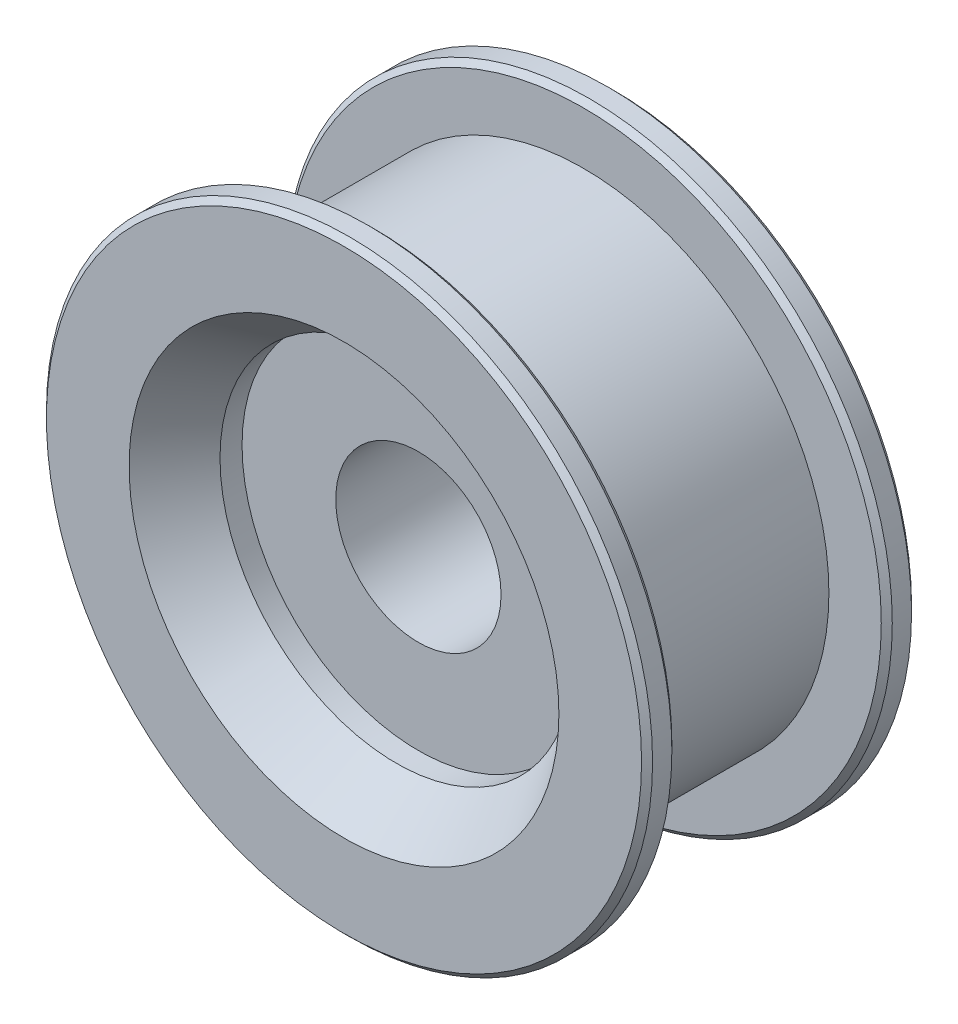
ISO-10303-21;
HEADER;
FILE_DESCRIPTION(('STEP AP214'),'2;1');
FILE_NAME('part.step','',(''),(''),'','','');
FILE_SCHEMA(('AUTOMOTIVE_DESIGN { 1 0 10303 214 1 1 1 1 }'));
ENDSEC;
DATA;
#1=APPLICATION_CONTEXT('core data for automotive mechanical design processes');
#2=APPLICATION_PROTOCOL_DEFINITION('international standard','automotive_design',2000,#1);
#3=PRODUCT_CONTEXT('',#1,'mechanical');
#4=PRODUCT('Part','Part','',(#3));
#5=PRODUCT_RELATED_PRODUCT_CATEGORY('part','',(#4));
#6=PRODUCT_DEFINITION_FORMATION('','',#4);
#7=PRODUCT_DEFINITION_CONTEXT('part definition',#1,'design');
#8=PRODUCT_DEFINITION('design','',#6,#7);
#9=PRODUCT_DEFINITION_SHAPE('','',#8);
#10=(LENGTH_UNIT() NAMED_UNIT(*) SI_UNIT(.MILLI.,.METRE.));
#11=(NAMED_UNIT(*) PLANE_ANGLE_UNIT() SI_UNIT($,.RADIAN.));
#12=(NAMED_UNIT(*) SI_UNIT($,.STERADIAN.) SOLID_ANGLE_UNIT());
#13=UNCERTAINTY_MEASURE_WITH_UNIT(LENGTH_MEASURE(1.E-05),#10,'distance_accuracy_value','');
#14=(GEOMETRIC_REPRESENTATION_CONTEXT(3) GLOBAL_UNCERTAINTY_ASSIGNED_CONTEXT((#13)) GLOBAL_UNIT_ASSIGNED_CONTEXT((#10,
#11,#12)) REPRESENTATION_CONTEXT('',''));
#15=CARTESIAN_POINT('',(0.,0.,0.));
#16=DIRECTION('',(0.,0.,1.));
#17=DIRECTION('',(1.,0.,0.));
#18=AXIS2_PLACEMENT_3D('',#15,#16,#17);
#19=CARTESIAN_POINT('',(0.,-7.5,-5.5));
#20=DIRECTION('',(0.,0.,-1.));
#21=DIRECTION('',(1.,0.,0.));
#22=AXIS2_PLACEMENT_3D('',#19,#20,#21);
#23=PLANE('',#22);
#24=CARTESIAN_POINT('',(0.,0.,-5.5));
#25=DIRECTION('',(0.,0.,-1.));
#26=DIRECTION('',(1.,0.,0.));
#27=AXIS2_PLACEMENT_3D('',#24,#25,#26);
#28=CIRCLE('',#27,16.);
#29=CARTESIAN_POINT('',(16.,0.,-5.5));
#30=VERTEX_POINT('',#29);
#31=EDGE_CURVE('E44',#30,#30,#28,.T.);
#32=ORIENTED_EDGE('',*,*,#31,.T.);
#33=EDGE_LOOP('',(#32));
#34=FACE_BOUND('',#33,.T.);
#35=CARTESIAN_POINT('',(0.,0.,-5.5));
#36=DIRECTION('',(0.,0.,-1.));
#37=DIRECTION('',(1.,0.,0.));
#38=AXIS2_PLACEMENT_3D('',#35,#36,#37);
#39=CIRCLE('',#38,7.5);
#40=CARTESIAN_POINT('',(7.5,0.,-5.5));
#41=VERTEX_POINT('',#40);
#42=EDGE_CURVE('E71',#41,#41,#39,.T.);
#43=ORIENTED_EDGE('',*,*,#42,.F.);
#44=EDGE_LOOP('',(#43));
#45=FACE_BOUND('',#44,.T.);
#46=ADVANCED_FACE('F12',(#34,#45),#23,.T.);
#47=CARTESIAN_POINT('',(0.,0.,-20.));
#48=DIRECTION('',(0.,0.,-1.));
#49=DIRECTION('',(1.,0.,0.));
#50=AXIS2_PLACEMENT_3D('',#47,#48,#49);
#51=CYLINDRICAL_SURFACE('',#50,16.);
#52=CARTESIAN_POINT('',(0.,0.,-7.5));
#53=DIRECTION('',(0.,0.,-1.));
#54=DIRECTION('',(1.,0.,0.));
#55=AXIS2_PLACEMENT_3D('',#52,#53,#54);
#56=CIRCLE('',#55,16.);
#57=CARTESIAN_POINT('',(16.,0.,-7.5));
#58=VERTEX_POINT('',#57);
#59=EDGE_CURVE('E47',#58,#58,#56,.T.);
#60=ORIENTED_EDGE('',*,*,#59,.T.);
#61=EDGE_LOOP('',(#60));
#62=FACE_BOUND('',#61,.T.);
#63=ORIENTED_EDGE('',*,*,#31,.F.);
#64=EDGE_LOOP('',(#63));
#65=FACE_BOUND('',#64,.T.);
#66=ADVANCED_FACE('F79',(#62,#65),#51,.F.);
#67=CARTESIAN_POINT('',(0.,0.,-7.5));
#68=DIRECTION('',(0.,0.,-1.));
#69=DIRECTION('',(1.,0.,0.));
#70=AXIS2_PLACEMENT_3D('',#67,#68,#69);
#71=CONICAL_SURFACE('',#70,16.,0.635026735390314);
#72=CARTESIAN_POINT('',(0.,0.,-12.25));
#73=DIRECTION('',(0.,0.,-1.));
#74=DIRECTION('',(1.,0.,0.));
#75=AXIS2_PLACEMENT_3D('',#72,#73,#74);
#76=CIRCLE('',#75,19.5);
#77=CARTESIAN_POINT('',(19.5,0.,-12.25));
#78=VERTEX_POINT('',#77);
#79=EDGE_CURVE('E50',#78,#78,#76,.T.);
#80=ORIENTED_EDGE('',*,*,#79,.T.);
#81=EDGE_LOOP('',(#80));
#82=FACE_BOUND('',#81,.T.);
#83=ORIENTED_EDGE('',*,*,#59,.F.);
#84=EDGE_LOOP('',(#83));
#85=FACE_BOUND('',#84,.T.);
#86=ADVANCED_FACE('F87',(#82,#85),#71,.F.);
#87=CARTESIAN_POINT('',(0.,-27.5,-12.25));
#88=DIRECTION('',(0.,0.,1.));
#89=DIRECTION('',(-1.,0.,0.));
#90=AXIS2_PLACEMENT_3D('',#87,#88,#89);
#91=PLANE('',#90);
#92=CARTESIAN_POINT('',(0.,0.,-12.25));
#93=DIRECTION('',(0.,0.,1.));
#94=DIRECTION('',(1.,0.,0.));
#95=AXIS2_PLACEMENT_3D('',#92,#93,#94);
#96=CIRCLE('',#95,27.);
#97=CARTESIAN_POINT('',(27.,0.,-12.25));
#98=VERTEX_POINT('',#97);
#99=EDGE_CURVE('E41',#98,#98,#96,.F.);
#100=ORIENTED_EDGE('',*,*,#99,.T.);
#101=EDGE_LOOP('',(#100));
#102=FACE_BOUND('',#101,.T.);
#103=ORIENTED_EDGE('',*,*,#79,.F.);
#104=EDGE_LOOP('',(#103));
#105=FACE_BOUND('',#104,.T.);
#106=ADVANCED_FACE('F132',(#102,#105),#91,.F.);
#107=CARTESIAN_POINT('',(0.,0.,-20.));
#108=DIRECTION('',(0.,0.,-1.));
#109=DIRECTION('',(1.,0.,0.));
#110=AXIS2_PLACEMENT_3D('',#107,#108,#109);
#111=CYLINDRICAL_SURFACE('',#110,27.5);
#112=CARTESIAN_POINT('',(0.,0.,-11.75));
#113=DIRECTION('',(0.,0.,1.));
#114=DIRECTION('',(1.,0.,0.));
#115=AXIS2_PLACEMENT_3D('',#112,#113,#114);
#116=CIRCLE('',#115,27.5);
#117=CARTESIAN_POINT('',(27.5,0.,-11.75));
#118=VERTEX_POINT('',#117);
#119=EDGE_CURVE('E35',#118,#118,#116,.T.);
#120=ORIENTED_EDGE('',*,*,#119,.T.);
#121=EDGE_LOOP('',(#120));
#122=FACE_BOUND('',#121,.T.);
#123=CARTESIAN_POINT('',(0.,0.,-10.));
#124=DIRECTION('',(0.,0.,1.));
#125=DIRECTION('',(1.,0.,0.));
#126=AXIS2_PLACEMENT_3D('',#123,#124,#125);
#127=CIRCLE('',#126,27.5);
#128=CARTESIAN_POINT('',(27.5,0.,-10.));
#129=VERTEX_POINT('',#128);
#130=EDGE_CURVE('E38',#129,#129,#127,.F.);
#131=ORIENTED_EDGE('',*,*,#130,.T.);
#132=EDGE_LOOP('',(#131));
#133=FACE_BOUND('',#132,.T.);
#134=ADVANCED_FACE('F125',(#122,#133),#111,.T.);
#135=CARTESIAN_POINT('',(0.,-27.5,-9.5));
#136=DIRECTION('',(0.,0.,1.));
#137=DIRECTION('',(-1.,0.,0.));
#138=AXIS2_PLACEMENT_3D('',#135,#136,#137);
#139=PLANE('',#138);
#140=CARTESIAN_POINT('',(0.,0.,-9.5));
#141=DIRECTION('',(0.,0.,1.));
#142=DIRECTION('',(1.,0.,0.));
#143=AXIS2_PLACEMENT_3D('',#140,#141,#142);
#144=CIRCLE('',#143,27.);
#145=CARTESIAN_POINT('',(27.,0.,-9.5));
#146=VERTEX_POINT('',#145);
#147=EDGE_CURVE('E32',#146,#146,#144,.T.);
#148=ORIENTED_EDGE('',*,*,#147,.T.);
#149=EDGE_LOOP('',(#148));
#150=FACE_BOUND('',#149,.T.);
#151=CARTESIAN_POINT('',(0.,0.,-9.5));
#152=DIRECTION('',(0.,0.,-1.));
#153=DIRECTION('',(1.,0.,0.));
#154=AXIS2_PLACEMENT_3D('',#151,#152,#153);
#155=CIRCLE('',#154,22.25);
#156=CARTESIAN_POINT('',(22.25,0.,-9.5));
#157=VERTEX_POINT('',#156);
#158=EDGE_CURVE('E53',#157,#157,#155,.T.);
#159=ORIENTED_EDGE('',*,*,#158,.T.);
#160=EDGE_LOOP('',(#159));
#161=FACE_BOUND('',#160,.T.);
#162=ADVANCED_FACE('F120',(#150,#161),#139,.T.);
#163=CARTESIAN_POINT('',(0.,0.,-20.));
#164=DIRECTION('',(0.,0.,-1.));
#165=DIRECTION('',(1.,0.,0.));
#166=AXIS2_PLACEMENT_3D('',#163,#164,#165);
#167=CYLINDRICAL_SURFACE('',#166,22.25);
#168=CARTESIAN_POINT('',(0.,0.,9.5));
#169=DIRECTION('',(0.,0.,-1.));
#170=DIRECTION('',(1.,0.,0.));
#171=AXIS2_PLACEMENT_3D('',#168,#169,#170);
#172=CIRCLE('',#171,22.25);
#173=CARTESIAN_POINT('',(22.25,0.,9.5));
#174=VERTEX_POINT('',#173);
#175=EDGE_CURVE('E56',#174,#174,#172,.T.);
#176=ORIENTED_EDGE('',*,*,#175,.T.);
#177=EDGE_LOOP('',(#176));
#178=FACE_BOUND('',#177,.T.);
#179=ORIENTED_EDGE('',*,*,#158,.F.);
#180=EDGE_LOOP('',(#179));
#181=FACE_BOUND('',#180,.T.);
#182=ADVANCED_FACE('F114',(#178,#181),#167,.T.);
#183=CARTESIAN_POINT('',(0.,-27.5,9.5));
#184=DIRECTION('',(0.,0.,1.));
#185=DIRECTION('',(-1.,0.,0.));
#186=AXIS2_PLACEMENT_3D('',#183,#184,#185);
#187=PLANE('',#186);
#188=CARTESIAN_POINT('',(0.,0.,9.5));
#189=DIRECTION('',(0.,0.,1.));
#190=DIRECTION('',(1.,0.,0.));
#191=AXIS2_PLACEMENT_3D('',#188,#189,#190);
#192=CIRCLE('',#191,27.);
#193=CARTESIAN_POINT('',(27.,0.,9.5));
#194=VERTEX_POINT('',#193);
#195=EDGE_CURVE('E27',#194,#194,#192,.F.);
#196=ORIENTED_EDGE('',*,*,#195,.T.);
#197=EDGE_LOOP('',(#196));
#198=FACE_BOUND('',#197,.T.);
#199=ORIENTED_EDGE('',*,*,#175,.F.);
#200=EDGE_LOOP('',(#199));
#201=FACE_BOUND('',#200,.T.);
#202=ADVANCED_FACE('F110',(#198,#201),#187,.F.);
#203=CARTESIAN_POINT('',(0.,0.,-20.));
#204=DIRECTION('',(0.,0.,-1.));
#205=DIRECTION('',(1.,0.,0.));
#206=AXIS2_PLACEMENT_3D('',#203,#204,#205);
#207=CYLINDRICAL_SURFACE('',#206,27.5);
#208=CARTESIAN_POINT('',(0.,0.,10.));
#209=DIRECTION('',(0.,0.,1.));
#210=DIRECTION('',(1.,0.,0.));
#211=AXIS2_PLACEMENT_3D('',#208,#209,#210);
#212=CIRCLE('',#211,27.5);
#213=CARTESIAN_POINT('',(27.5,0.,10.));
#214=VERTEX_POINT('',#213);
#215=EDGE_CURVE('E19',#214,#214,#212,.T.);
#216=ORIENTED_EDGE('',*,*,#215,.T.);
#217=EDGE_LOOP('',(#216));
#218=FACE_BOUND('',#217,.T.);
#219=CARTESIAN_POINT('',(0.,0.,11.75));
#220=DIRECTION('',(0.,0.,1.));
#221=DIRECTION('',(1.,0.,0.));
#222=AXIS2_PLACEMENT_3D('',#219,#220,#221);
#223=CIRCLE('',#222,27.5);
#224=CARTESIAN_POINT('',(27.5,0.,11.75));
#225=VERTEX_POINT('',#224);
#226=EDGE_CURVE('E23',#225,#225,#223,.F.);
#227=ORIENTED_EDGE('',*,*,#226,.T.);
#228=EDGE_LOOP('',(#227));
#229=FACE_BOUND('',#228,.T.);
#230=ADVANCED_FACE('F113',(#218,#229),#207,.T.);
#231=CARTESIAN_POINT('',(0.,-27.5,12.25));
#232=DIRECTION('',(0.,0.,1.));
#233=DIRECTION('',(-1.,0.,0.));
#234=AXIS2_PLACEMENT_3D('',#231,#232,#233);
#235=PLANE('',#234);
#236=CARTESIAN_POINT('',(0.,0.,12.25));
#237=DIRECTION('',(0.,0.,1.));
#238=DIRECTION('',(1.,0.,0.));
#239=AXIS2_PLACEMENT_3D('',#236,#237,#238);
#240=CIRCLE('',#239,27.);
#241=CARTESIAN_POINT('',(27.,0.,12.25));
#242=VERTEX_POINT('',#241);
#243=EDGE_CURVE('E8',#242,#242,#240,.T.);
#244=ORIENTED_EDGE('',*,*,#243,.T.);
#245=EDGE_LOOP('',(#244));
#246=FACE_BOUND('',#245,.T.);
#247=CARTESIAN_POINT('',(0.,0.,12.25));
#248=DIRECTION('',(0.,0.,-1.));
#249=DIRECTION('',(1.,0.,0.));
#250=AXIS2_PLACEMENT_3D('',#247,#248,#249);
#251=CIRCLE('',#250,19.5);
#252=CARTESIAN_POINT('',(19.5,0.,12.25));
#253=VERTEX_POINT('',#252);
#254=EDGE_CURVE('E59',#253,#253,#251,.T.);
#255=ORIENTED_EDGE('',*,*,#254,.T.);
#256=EDGE_LOOP('',(#255));
#257=FACE_BOUND('',#256,.T.);
#258=ADVANCED_FACE('F250',(#246,#257),#235,.T.);
#259=CARTESIAN_POINT('',(0.,0.,7.5));
#260=DIRECTION('',(0.,0.,1.));
#261=DIRECTION('',(-1.,0.,0.));
#262=AXIS2_PLACEMENT_3D('',#259,#260,#261);
#263=CONICAL_SURFACE('',#262,16.,0.635026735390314);
#264=ORIENTED_EDGE('',*,*,#254,.F.);
#265=EDGE_LOOP('',(#264));
#266=FACE_BOUND('',#265,.T.);
#267=CARTESIAN_POINT('',(0.,0.,7.5));
#268=DIRECTION('',(0.,0.,-1.));
#269=DIRECTION('',(1.,0.,0.));
#270=AXIS2_PLACEMENT_3D('',#267,#268,#269);
#271=CIRCLE('',#270,16.);
#272=CARTESIAN_POINT('',(16.,0.,7.5));
#273=VERTEX_POINT('',#272);
#274=EDGE_CURVE('E62',#273,#273,#271,.T.);
#275=ORIENTED_EDGE('',*,*,#274,.T.);
#276=EDGE_LOOP('',(#275));
#277=FACE_BOUND('',#276,.T.);
#278=ADVANCED_FACE('F241',(#266,#277),#263,.F.);
#279=CARTESIAN_POINT('',(0.,0.,-20.));
#280=DIRECTION('',(0.,0.,-1.));
#281=DIRECTION('',(1.,0.,0.));
#282=AXIS2_PLACEMENT_3D('',#279,#280,#281);
#283=CYLINDRICAL_SURFACE('',#282,16.);
#284=ORIENTED_EDGE('',*,*,#274,.F.);
#285=EDGE_LOOP('',(#284));
#286=FACE_BOUND('',#285,.T.);
#287=CARTESIAN_POINT('',(0.,0.,5.5));
#288=DIRECTION('',(0.,0.,-1.));
#289=DIRECTION('',(1.,0.,0.));
#290=AXIS2_PLACEMENT_3D('',#287,#288,#289);
#291=CIRCLE('',#290,16.);
#292=CARTESIAN_POINT('',(16.,0.,5.5));
#293=VERTEX_POINT('',#292);
#294=EDGE_CURVE('E65',#293,#293,#291,.T.);
#295=ORIENTED_EDGE('',*,*,#294,.T.);
#296=EDGE_LOOP('',(#295));
#297=FACE_BOUND('',#296,.T.);
#298=ADVANCED_FACE('F232',(#286,#297),#283,.F.);
#299=CARTESIAN_POINT('',(0.,-7.5,5.5));
#300=DIRECTION('',(0.,0.,-1.));
#301=DIRECTION('',(1.,0.,0.));
#302=AXIS2_PLACEMENT_3D('',#299,#300,#301);
#303=PLANE('',#302);
#304=ORIENTED_EDGE('',*,*,#294,.F.);
#305=EDGE_LOOP('',(#304));
#306=FACE_BOUND('',#305,.T.);
#307=CARTESIAN_POINT('',(0.,0.,5.5));
#308=DIRECTION('',(0.,0.,-1.));
#309=DIRECTION('',(1.,0.,0.));
#310=AXIS2_PLACEMENT_3D('',#307,#308,#309);
#311=CIRCLE('',#310,7.5);
#312=CARTESIAN_POINT('',(7.5,0.,5.5));
#313=VERTEX_POINT('',#312);
#314=EDGE_CURVE('E68',#313,#313,#311,.T.);
#315=ORIENTED_EDGE('',*,*,#314,.T.);
#316=EDGE_LOOP('',(#315));
#317=FACE_BOUND('',#316,.T.);
#318=ADVANCED_FACE('F225',(#306,#317),#303,.F.);
#319=CARTESIAN_POINT('',(0.,0.,-20.));
#320=DIRECTION('',(0.,0.,-1.));
#321=DIRECTION('',(1.,0.,0.));
#322=AXIS2_PLACEMENT_3D('',#319,#320,#321);
#323=CYLINDRICAL_SURFACE('',#322,7.5);
#324=ORIENTED_EDGE('',*,*,#42,.T.);
#325=EDGE_LOOP('',(#324));
#326=FACE_BOUND('',#325,.T.);
#327=ORIENTED_EDGE('',*,*,#314,.F.);
#328=EDGE_LOOP('',(#327));
#329=FACE_BOUND('',#328,.T.);
#330=ADVANCED_FACE('F75',(#326,#329),#323,.F.);
#331=CARTESIAN_POINT('',(0.,0.,-12.25));
#332=DIRECTION('',(0.,0.,1.));
#333=DIRECTION('',(1.,0.,0.));
#334=AXIS2_PLACEMENT_3D('',#331,#332,#333);
#335=CONICAL_SURFACE('',#334,27.,0.785398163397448);
#336=ORIENTED_EDGE('',*,*,#119,.F.);
#337=EDGE_LOOP('',(#336));
#338=FACE_BOUND('',#337,.T.);
#339=ORIENTED_EDGE('',*,*,#99,.F.);
#340=EDGE_LOOP('',(#339));
#341=FACE_BOUND('',#340,.T.);
#342=ADVANCED_FACE('F92',(#338,#341),#335,.T.);
#343=CARTESIAN_POINT('',(0.,0.,-10.));
#344=DIRECTION('',(0.,0.,-1.));
#345=DIRECTION('',(-1.,0.,0.));
#346=AXIS2_PLACEMENT_3D('',#343,#344,#345);
#347=CONICAL_SURFACE('',#346,27.5,0.785398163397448);
#348=ORIENTED_EDGE('',*,*,#147,.F.);
#349=EDGE_LOOP('',(#348));
#350=FACE_BOUND('',#349,.T.);
#351=ORIENTED_EDGE('',*,*,#130,.F.);
#352=EDGE_LOOP('',(#351));
#353=FACE_BOUND('',#352,.T.);
#354=ADVANCED_FACE('F95',(#350,#353),#347,.T.);
#355=CARTESIAN_POINT('',(0.,0.,9.5));
#356=DIRECTION('',(0.,0.,1.));
#357=DIRECTION('',(1.,0.,0.));
#358=AXIS2_PLACEMENT_3D('',#355,#356,#357);
#359=CONICAL_SURFACE('',#358,27.,0.785398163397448);
#360=ORIENTED_EDGE('',*,*,#215,.F.);
#361=EDGE_LOOP('',(#360));
#362=FACE_BOUND('',#361,.T.);
#363=ORIENTED_EDGE('',*,*,#195,.F.);
#364=EDGE_LOOP('',(#363));
#365=FACE_BOUND('',#364,.T.);
#366=ADVANCED_FACE('F98',(#362,#365),#359,.T.);
#367=CARTESIAN_POINT('',(0.,0.,11.75));
#368=DIRECTION('',(0.,0.,-1.));
#369=DIRECTION('',(-1.,0.,0.));
#370=AXIS2_PLACEMENT_3D('',#367,#368,#369);
#371=CONICAL_SURFACE('',#370,27.5,0.785398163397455);
#372=ORIENTED_EDGE('',*,*,#243,.F.);
#373=EDGE_LOOP('',(#372));
#374=FACE_BOUND('',#373,.T.);
#375=ORIENTED_EDGE('',*,*,#226,.F.);
#376=EDGE_LOOP('',(#375));
#377=FACE_BOUND('',#376,.T.);
#378=ADVANCED_FACE('F14',(#374,#377),#371,.T.);
#379=CLOSED_SHELL('',(#46,#66,#86,#106,#134,#162,#182,#202,#230,#258,#278,#298,#318,#330,#342,
#354,#366,#378));
#380=MANIFOLD_SOLID_BREP('B1',#379);
#381=ADVANCED_BREP_SHAPE_REPRESENTATION('',(#18,#380),#14);
#382=SHAPE_DEFINITION_REPRESENTATION(#9,#381);
ENDSEC;
END-ISO-10303-21;
